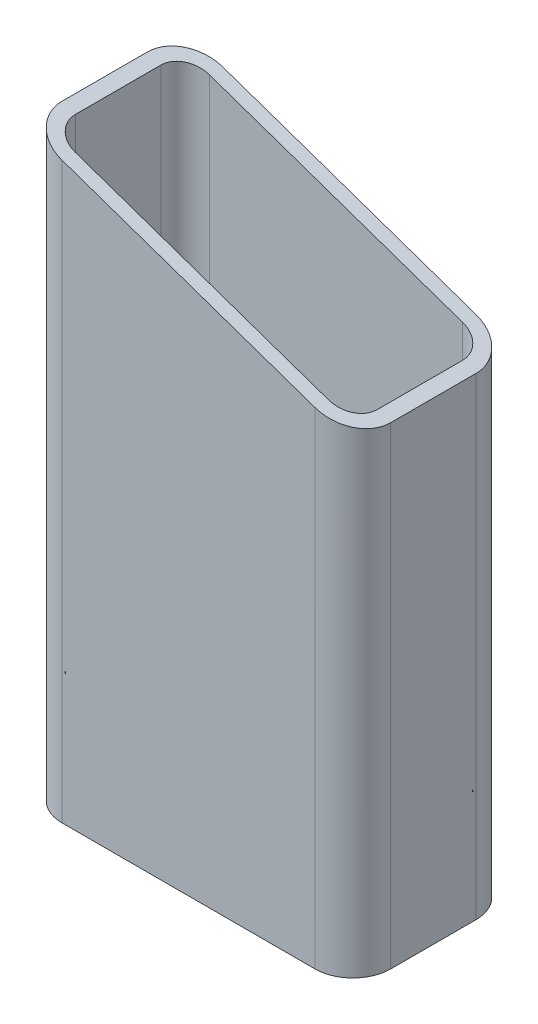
ISO-10303-21;
HEADER;
FILE_DESCRIPTION(('STEP AP214'),'2;1');
FILE_NAME('part.step','',(''),(''),'','','');
FILE_SCHEMA(('AUTOMOTIVE_DESIGN { 1 0 10303 214 1 1 1 1 }'));
ENDSEC;
DATA;
#1=APPLICATION_CONTEXT('core data for automotive mechanical design processes');
#2=APPLICATION_PROTOCOL_DEFINITION('international standard','automotive_design',2000,#1);
#3=PRODUCT_CONTEXT('',#1,'mechanical');
#4=PRODUCT('Part','Part','',(#3));
#5=PRODUCT_RELATED_PRODUCT_CATEGORY('part','',(#4));
#6=PRODUCT_DEFINITION_FORMATION('','',#4);
#7=PRODUCT_DEFINITION_CONTEXT('part definition',#1,'design');
#8=PRODUCT_DEFINITION('design','',#6,#7);
#9=PRODUCT_DEFINITION_SHAPE('','',#8);
#10=(LENGTH_UNIT() NAMED_UNIT(*) SI_UNIT(.MILLI.,.METRE.));
#11=(NAMED_UNIT(*) PLANE_ANGLE_UNIT() SI_UNIT($,.RADIAN.));
#12=(NAMED_UNIT(*) SI_UNIT($,.STERADIAN.) SOLID_ANGLE_UNIT());
#13=UNCERTAINTY_MEASURE_WITH_UNIT(LENGTH_MEASURE(1.E-05),#10,'distance_accuracy_value','');
#14=(GEOMETRIC_REPRESENTATION_CONTEXT(3) GLOBAL_UNCERTAINTY_ASSIGNED_CONTEXT((#13)) GLOBAL_UNIT_ASSIGNED_CONTEXT((#10,
#11,#12)) REPRESENTATION_CONTEXT('',''));
#15=CARTESIAN_POINT('',(0.,0.,0.));
#16=DIRECTION('',(0.,0.,1.));
#17=DIRECTION('',(1.,0.,0.));
#18=AXIS2_PLACEMENT_3D('',#15,#16,#17);
#19=CARTESIAN_POINT('',(90.,350.,0.));
#20=DIRECTION('',(1.,0.,0.));
#21=DIRECTION('',(0.,0.,-1.));
#22=AXIS2_PLACEMENT_3D('',#19,#20,#21);
#23=PLANE('',#22);
#24=DIRECTION('',(0.,-1.,0.));
#25=VECTOR('',#24,1.);
#26=CARTESIAN_POINT('',(90.,350.,25.5));
#27=LINE('',#26,#25);
#28=CARTESIAN_POINT('',(90.,284.83571951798,25.5));
#29=VERTEX_POINT('',#28);
#30=CARTESIAN_POINT('',(90.,0.,25.5));
#31=VERTEX_POINT('',#30);
#32=EDGE_CURVE('E11',#29,#31,#27,.T.);
#33=ORIENTED_EDGE('',*,*,#32,.F.);
#34=DIRECTION('',(0.,0.,-1.));
#35=VECTOR('',#34,1.);
#36=CARTESIAN_POINT('',(90.,284.83571951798,0.));
#37=LINE('',#36,#35);
#38=CARTESIAN_POINT('',(90.,284.83571951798,-25.5000000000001));
#39=VERTEX_POINT('',#38);
#40=EDGE_CURVE('E258',#29,#39,#37,.T.);
#41=ORIENTED_EDGE('',*,*,#40,.T.);
#42=DIRECTION('',(0.,-1.,0.));
#43=VECTOR('',#42,1.);
#44=CARTESIAN_POINT('',(90.,350.,-25.5000000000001));
#45=LINE('',#44,#43);
#46=CARTESIAN_POINT('',(90.,0.,-25.5000000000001));
#47=VERTEX_POINT('',#46);
#48=EDGE_CURVE('E122',#39,#47,#45,.T.);
#49=ORIENTED_EDGE('',*,*,#48,.T.);
#50=DIRECTION('',(0.,0.,1.));
#51=VECTOR('',#50,1.);
#52=CARTESIAN_POINT('',(90.,0.,0.));
#53=LINE('',#52,#51);
#54=EDGE_CURVE('E137',#47,#31,#53,.T.);
#55=ORIENTED_EDGE('',*,*,#54,.T.);
#56=EDGE_LOOP('',(#33,#41,#49,#55));
#57=FACE_BOUND('',#56,.T.);
#58=ADVANCED_FACE('F34',(#57),#23,.F.);
#59=CARTESIAN_POINT('',(75.5,350.,25.5));
#60=DIRECTION('',(0.,-1.,0.));
#61=DIRECTION('',(0.,0.,-1.));
#62=AXIS2_PLACEMENT_3D('',#59,#60,#61);
#63=CYLINDRICAL_SURFACE('',#62,14.5);
#64=DIRECTION('',(0.,-1.,0.));
#65=VECTOR('',#64,1.);
#66=CARTESIAN_POINT('',(75.5,350.,40.));
#67=LINE('',#66,#65);
#68=CARTESIAN_POINT('',(75.5,289.861687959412,40.));
#69=VERTEX_POINT('',#68);
#70=CARTESIAN_POINT('',(75.5,0.,40.));
#71=VERTEX_POINT('',#70);
#72=EDGE_CURVE('E43',#69,#71,#67,.T.);
#73=ORIENTED_EDGE('',*,*,#72,.F.);
#74=CARTESIAN_POINT('',(75.5,289.861687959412,25.5));
#75=DIRECTION('',(-0.327502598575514,-0.944850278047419,0.));
#76=DIRECTION('',(0.94485027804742,-0.327502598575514,0.));
#77=AXIS2_PLACEMENT_3D('',#74,#75,#76);
#78=ELLIPSE('',#77,15.3463467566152,14.5);
#79=EDGE_CURVE('E253',#69,#29,#78,.F.);
#80=ORIENTED_EDGE('',*,*,#79,.T.);
#81=ORIENTED_EDGE('',*,*,#32,.T.);
#82=CARTESIAN_POINT('',(75.5,0.,25.5));
#83=DIRECTION('',(0.,1.,0.));
#84=DIRECTION('',(0.,0.,1.));
#85=AXIS2_PLACEMENT_3D('',#82,#83,#84);
#86=CIRCLE('',#85,14.5);
#87=EDGE_CURVE('E209',#31,#71,#86,.F.);
#88=ORIENTED_EDGE('',*,*,#87,.T.);
#89=EDGE_LOOP('',(#73,#80,#81,#88));
#90=FACE_BOUND('',#89,.T.);
#91=ADVANCED_FACE('F250',(#90),#63,.F.);
#92=CARTESIAN_POINT('',(0.,350.,40.));
#93=DIRECTION('',(0.,0.,-1.));
#94=DIRECTION('',(-1.,0.,0.));
#95=AXIS2_PLACEMENT_3D('',#92,#93,#94);
#96=PLANE('',#95);
#97=DIRECTION('',(-0.94485027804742,0.327502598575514,0.));
#98=VECTOR('',#97,1.);
#99=CARTESIAN_POINT('',(-10.511279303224,319.674789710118,40.));
#100=LINE('',#99,#98);
#101=CARTESIAN_POINT('',(-75.5,342.20108345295,40.0000000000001));
#102=VERTEX_POINT('',#101);
#103=EDGE_CURVE('E247',#69,#102,#100,.T.);
#104=ORIENTED_EDGE('',*,*,#103,.F.);
#105=ORIENTED_EDGE('',*,*,#72,.T.);
#106=DIRECTION('',(1.,0.,0.));
#107=VECTOR('',#106,1.);
#108=CARTESIAN_POINT('',(0.,0.,40.));
#109=LINE('',#108,#107);
#110=CARTESIAN_POINT('',(-75.5,0.,40.0000000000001));
#111=VERTEX_POINT('',#110);
#112=EDGE_CURVE('E212',#111,#71,#109,.T.);
#113=ORIENTED_EDGE('',*,*,#112,.F.);
#114=DIRECTION('',(0.,-1.,0.));
#115=VECTOR('',#114,1.);
#116=CARTESIAN_POINT('',(-75.5,350.,40.0000000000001));
#117=LINE('',#116,#115);
#118=EDGE_CURVE('E150',#102,#111,#117,.T.);
#119=ORIENTED_EDGE('',*,*,#118,.F.);
#120=EDGE_LOOP('',(#104,#105,#113,#119));
#121=FACE_BOUND('',#120,.T.);
#122=ADVANCED_FACE('F242',(#121),#96,.T.);
#123=CARTESIAN_POINT('',(-75.5,350.,25.5000000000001));
#124=DIRECTION('',(0.,-1.,0.));
#125=DIRECTION('',(0.,0.,-1.));
#126=AXIS2_PLACEMENT_3D('',#123,#124,#125);
#127=CYLINDRICAL_SURFACE('',#126,14.5);
#128=CARTESIAN_POINT('',(-75.5,342.20108345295,25.5000000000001));
#129=DIRECTION('',(-0.327502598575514,-0.944850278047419,0.));
#130=DIRECTION('',(0.94485027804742,-0.327502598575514,0.));
#131=AXIS2_PLACEMENT_3D('',#128,#129,#130);
#132=ELLIPSE('',#131,15.3463467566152,14.5);
#133=CARTESIAN_POINT('',(-90.,347.227051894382,25.5000000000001));
#134=VERTEX_POINT('',#133);
#135=EDGE_CURVE('E569',#102,#134,#132,.T.);
#136=ORIENTED_EDGE('',*,*,#135,.F.);
#137=ORIENTED_EDGE('',*,*,#118,.T.);
#138=CARTESIAN_POINT('',(-75.5,0.,25.5000000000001));
#139=DIRECTION('',(0.,1.,0.));
#140=DIRECTION('',(0.,0.,1.));
#141=AXIS2_PLACEMENT_3D('',#138,#139,#140);
#142=CIRCLE('',#141,14.5);
#143=CARTESIAN_POINT('',(-90.,0.,25.5000000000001));
#144=VERTEX_POINT('',#143);
#145=EDGE_CURVE('E215',#144,#111,#142,.T.);
#146=ORIENTED_EDGE('',*,*,#145,.F.);
#147=DIRECTION('',(0.,-1.,0.));
#148=VECTOR('',#147,1.);
#149=CARTESIAN_POINT('',(-90.,350.,25.5000000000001));
#150=LINE('',#149,#148);
#151=EDGE_CURVE('E148',#134,#144,#150,.T.);
#152=ORIENTED_EDGE('',*,*,#151,.F.);
#153=EDGE_LOOP('',(#136,#137,#146,#152));
#154=FACE_BOUND('',#153,.T.);
#155=ADVANCED_FACE('F237',(#154),#127,.F.);
#156=CARTESIAN_POINT('',(-90.,350.,0.));
#157=DIRECTION('',(1.,0.,0.));
#158=DIRECTION('',(0.,0.,-1.));
#159=AXIS2_PLACEMENT_3D('',#156,#157,#158);
#160=PLANE('',#159);
#161=DIRECTION('',(0.,0.,-1.));
#162=VECTOR('',#161,1.);
#163=CARTESIAN_POINT('',(-90.,347.227051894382,0.));
#164=LINE('',#163,#162);
#165=CARTESIAN_POINT('',(-90.,347.227051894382,-25.5000000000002));
#166=VERTEX_POINT('',#165);
#167=EDGE_CURVE('E234',#134,#166,#164,.T.);
#168=ORIENTED_EDGE('',*,*,#167,.F.);
#169=ORIENTED_EDGE('',*,*,#151,.T.);
#170=DIRECTION('',(0.,0.,1.));
#171=VECTOR('',#170,1.);
#172=CARTESIAN_POINT('',(-90.,0.,0.));
#173=LINE('',#172,#171);
#174=CARTESIAN_POINT('',(-90.,0.,-25.5000000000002));
#175=VERTEX_POINT('',#174);
#176=EDGE_CURVE('E218',#175,#144,#173,.T.);
#177=ORIENTED_EDGE('',*,*,#176,.F.);
#178=DIRECTION('',(0.,-1.,0.));
#179=VECTOR('',#178,1.);
#180=CARTESIAN_POINT('',(-90.,350.,-25.5000000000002));
#181=LINE('',#180,#179);
#182=EDGE_CURVE('E146',#166,#175,#181,.T.);
#183=ORIENTED_EDGE('',*,*,#182,.F.);
#184=EDGE_LOOP('',(#168,#169,#177,#183));
#185=FACE_BOUND('',#184,.T.);
#186=ADVANCED_FACE('F228',(#185),#160,.T.);
#187=CARTESIAN_POINT('',(-75.5,350.,-25.5000000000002));
#188=DIRECTION('',(0.,-1.,0.));
#189=DIRECTION('',(0.,0.,-1.));
#190=AXIS2_PLACEMENT_3D('',#187,#188,#189);
#191=CYLINDRICAL_SURFACE('',#190,14.5);
#192=DIRECTION('',(0.,-1.,0.));
#193=VECTOR('',#192,1.);
#194=CARTESIAN_POINT('',(-75.5,350.,-40.0000000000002));
#195=LINE('',#194,#193);
#196=CARTESIAN_POINT('',(-75.5,342.20108345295,-40.0000000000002));
#197=VERTEX_POINT('',#196);
#198=CARTESIAN_POINT('',(-75.5,0.,-40.0000000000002));
#199=VERTEX_POINT('',#198);
#200=EDGE_CURVE('E121',#197,#199,#195,.T.);
#201=ORIENTED_EDGE('',*,*,#200,.F.);
#202=CARTESIAN_POINT('',(-75.5,342.20108345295,-25.5000000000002));
#203=DIRECTION('',(-0.327502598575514,-0.944850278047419,0.));
#204=DIRECTION('',(0.94485027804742,-0.327502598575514,0.));
#205=AXIS2_PLACEMENT_3D('',#202,#203,#204);
#206=ELLIPSE('',#205,15.3463467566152,14.5);
#207=EDGE_CURVE('E572',#197,#166,#206,.F.);
#208=ORIENTED_EDGE('',*,*,#207,.T.);
#209=ORIENTED_EDGE('',*,*,#182,.T.);
#210=CARTESIAN_POINT('',(-75.5,0.,-25.5000000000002));
#211=DIRECTION('',(0.,1.,0.));
#212=DIRECTION('',(0.,0.,1.));
#213=AXIS2_PLACEMENT_3D('',#210,#211,#212);
#214=CIRCLE('',#213,14.5);
#215=EDGE_CURVE('E131',#175,#199,#214,.F.);
#216=ORIENTED_EDGE('',*,*,#215,.T.);
#217=EDGE_LOOP('',(#201,#208,#209,#216));
#218=FACE_BOUND('',#217,.T.);
#219=ADVANCED_FACE('F221',(#218),#191,.F.);
#220=CARTESIAN_POINT('',(0.,350.,-40.0000000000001));
#221=DIRECTION('',(0.,0.,-1.));
#222=DIRECTION('',(-1.,0.,0.));
#223=AXIS2_PLACEMENT_3D('',#220,#221,#222);
#224=PLANE('',#223);
#225=DIRECTION('',(0.,-1.,0.));
#226=VECTOR('',#225,1.);
#227=CARTESIAN_POINT('',(75.5,350.,-40.0000000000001));
#228=LINE('',#227,#226);
#229=CARTESIAN_POINT('',(75.5,289.861687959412,-40.0000000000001));
#230=VERTEX_POINT('',#229);
#231=CARTESIAN_POINT('',(75.5,0.,-40.0000000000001));
#232=VERTEX_POINT('',#231);
#233=EDGE_CURVE('E113',#230,#232,#228,.T.);
#234=ORIENTED_EDGE('',*,*,#233,.F.);
#235=DIRECTION('',(-0.94485027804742,0.327502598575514,0.));
#236=VECTOR('',#235,1.);
#237=CARTESIAN_POINT('',(-10.511279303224,319.674789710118,-40.0000000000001));
#238=LINE('',#237,#236);
#239=EDGE_CURVE('E51',#230,#197,#238,.T.);
#240=ORIENTED_EDGE('',*,*,#239,.T.);
#241=ORIENTED_EDGE('',*,*,#200,.T.);
#242=DIRECTION('',(1.,0.,0.));
#243=VECTOR('',#242,1.);
#244=CARTESIAN_POINT('',(0.,0.,-40.0000000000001));
#245=LINE('',#244,#243);
#246=EDGE_CURVE('E125',#199,#232,#245,.T.);
#247=ORIENTED_EDGE('',*,*,#246,.T.);
#248=EDGE_LOOP('',(#234,#240,#241,#247));
#249=FACE_BOUND('',#248,.T.);
#250=ADVANCED_FACE('F126',(#249),#224,.F.);
#251=CARTESIAN_POINT('',(75.5,350.,25.5));
#252=DIRECTION('',(0.,-1.,0.));
#253=DIRECTION('',(0.,0.,-1.));
#254=AXIS2_PLACEMENT_3D('',#251,#252,#253);
#255=CYLINDRICAL_SURFACE('',#254,22.5);
#256=CARTESIAN_POINT('',(75.5,289.861687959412,25.5));
#257=DIRECTION('',(-0.327502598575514,-0.944850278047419,0.));
#258=DIRECTION('',(0.94485027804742,-0.327502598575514,0.));
#259=AXIS2_PLACEMENT_3D('',#256,#257,#258);
#260=ELLIPSE('',#259,23.8132966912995,22.5);
#261=CARTESIAN_POINT('',(75.5000000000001,289.861687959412,48.));
#262=VERTEX_POINT('',#261);
#263=CARTESIAN_POINT('',(98.,282.062771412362,25.4999999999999));
#264=VERTEX_POINT('',#263);
#265=EDGE_CURVE('E189',#262,#264,#260,.F.);
#266=ORIENTED_EDGE('',*,*,#265,.F.);
#267=DIRECTION('',(0.,-1.,0.));
#268=VECTOR('',#267,1.);
#269=CARTESIAN_POINT('',(75.5,350.,48.));
#270=LINE('',#269,#268);
#271=CARTESIAN_POINT('',(75.5,0.,48.));
#272=VERTEX_POINT('',#271);
#273=EDGE_CURVE('E140',#262,#272,#270,.T.);
#274=ORIENTED_EDGE('',*,*,#273,.T.);
#275=CARTESIAN_POINT('',(75.5,0.,25.5));
#276=DIRECTION('',(0.,1.,0.));
#277=DIRECTION('',(0.,0.,1.));
#278=AXIS2_PLACEMENT_3D('',#275,#276,#277);
#279=CIRCLE('',#278,22.5);
#280=CARTESIAN_POINT('',(98.,0.,25.5));
#281=VERTEX_POINT('',#280);
#282=EDGE_CURVE('E184',#281,#272,#279,.F.);
#283=ORIENTED_EDGE('',*,*,#282,.F.);
#284=DIRECTION('',(0.,-1.,0.));
#285=VECTOR('',#284,1.);
#286=CARTESIAN_POINT('',(98.,350.,25.5));
#287=LINE('',#286,#285);
#288=EDGE_CURVE('E38',#264,#281,#287,.T.);
#289=ORIENTED_EDGE('',*,*,#288,.F.);
#290=EDGE_LOOP('',(#266,#274,#283,#289));
#291=FACE_BOUND('',#290,.T.);
#292=ADVANCED_FACE('F36',(#291),#255,.T.);
#293=CARTESIAN_POINT('',(98.,350.,0.));
#294=DIRECTION('',(1.,0.,0.));
#295=DIRECTION('',(0.,0.,-1.));
#296=AXIS2_PLACEMENT_3D('',#293,#294,#295);
#297=PLANE('',#296);
#298=DIRECTION('',(0.,0.,1.));
#299=VECTOR('',#298,1.);
#300=CARTESIAN_POINT('',(98.,282.062771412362,-48.0000000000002));
#301=LINE('',#300,#299);
#302=CARTESIAN_POINT('',(98.,282.062771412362,-25.5000000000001));
#303=VERTEX_POINT('',#302);
#304=EDGE_CURVE('E180',#303,#264,#301,.T.);
#305=ORIENTED_EDGE('',*,*,#304,.T.);
#306=ORIENTED_EDGE('',*,*,#288,.T.);
#307=DIRECTION('',(0.,0.,1.));
#308=VECTOR('',#307,1.);
#309=CARTESIAN_POINT('',(98.,0.,0.));
#310=LINE('',#309,#308);
#311=CARTESIAN_POINT('',(98.,0.,-25.5000000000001));
#312=VERTEX_POINT('',#311);
#313=EDGE_CURVE('E177',#312,#281,#310,.T.);
#314=ORIENTED_EDGE('',*,*,#313,.F.);
#315=DIRECTION('',(0.,-1.,0.));
#316=VECTOR('',#315,1.);
#317=CARTESIAN_POINT('',(98.,350.,-25.5000000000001));
#318=LINE('',#317,#316);
#319=EDGE_CURVE('E164',#303,#312,#318,.T.);
#320=ORIENTED_EDGE('',*,*,#319,.F.);
#321=EDGE_LOOP('',(#305,#306,#314,#320));
#322=FACE_BOUND('',#321,.T.);
#323=ADVANCED_FACE('F175',(#322),#297,.T.);
#324=CARTESIAN_POINT('',(75.5,350.,-25.5000000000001));
#325=DIRECTION('',(0.,-1.,0.));
#326=DIRECTION('',(0.,0.,-1.));
#327=AXIS2_PLACEMENT_3D('',#324,#325,#326);
#328=CYLINDRICAL_SURFACE('',#327,22.5);
#329=DIRECTION('',(0.,-1.,0.));
#330=VECTOR('',#329,1.);
#331=CARTESIAN_POINT('',(75.5,350.,-48.0000000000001));
#332=LINE('',#331,#330);
#333=CARTESIAN_POINT('',(75.5000000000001,289.861687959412,-48.0000000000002));
#334=VERTEX_POINT('',#333);
#335=CARTESIAN_POINT('',(75.5,0.,-48.0000000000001));
#336=VERTEX_POINT('',#335);
#337=EDGE_CURVE('E163',#334,#336,#332,.T.);
#338=ORIENTED_EDGE('',*,*,#337,.F.);
#339=CARTESIAN_POINT('',(75.5,289.861687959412,-25.5000000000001));
#340=DIRECTION('',(-0.327502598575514,-0.944850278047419,0.));
#341=DIRECTION('',(0.94485027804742,-0.327502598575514,0.));
#342=AXIS2_PLACEMENT_3D('',#339,#340,#341);
#343=ELLIPSE('',#342,23.8132966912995,22.5);
#344=EDGE_CURVE('E561',#334,#303,#343,.T.);
#345=ORIENTED_EDGE('',*,*,#344,.T.);
#346=ORIENTED_EDGE('',*,*,#319,.T.);
#347=CARTESIAN_POINT('',(75.5,0.,-25.5000000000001));
#348=DIRECTION('',(0.,1.,0.));
#349=DIRECTION('',(0.,0.,1.));
#350=AXIS2_PLACEMENT_3D('',#347,#348,#349);
#351=CIRCLE('',#350,22.5);
#352=EDGE_CURVE('E192',#312,#336,#351,.T.);
#353=ORIENTED_EDGE('',*,*,#352,.T.);
#354=EDGE_LOOP('',(#338,#345,#346,#353));
#355=FACE_BOUND('',#354,.T.);
#356=ADVANCED_FACE('F309',(#355),#328,.T.);
#357=CARTESIAN_POINT('',(0.,350.,-48.0000000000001));
#358=DIRECTION('',(0.,0.,-1.));
#359=DIRECTION('',(-1.,0.,0.));
#360=AXIS2_PLACEMENT_3D('',#357,#358,#359);
#361=PLANE('',#360);
#362=DIRECTION('',(0.94485027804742,-0.327502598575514,0.));
#363=VECTOR('',#362,1.);
#364=CARTESIAN_POINT('',(-98.,350.,-48.0000000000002));
#365=LINE('',#364,#363);
#366=CARTESIAN_POINT('',(-75.5,342.20108345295,-48.0000000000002));
#367=VERTEX_POINT('',#366);
#368=EDGE_CURVE('E294',#367,#334,#365,.T.);
#369=ORIENTED_EDGE('',*,*,#368,.T.);
#370=ORIENTED_EDGE('',*,*,#337,.T.);
#371=DIRECTION('',(1.,0.,0.));
#372=VECTOR('',#371,1.);
#373=CARTESIAN_POINT('',(0.,0.,-48.0000000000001));
#374=LINE('',#373,#372);
#375=CARTESIAN_POINT('',(-75.5,0.,-48.0000000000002));
#376=VERTEX_POINT('',#375);
#377=EDGE_CURVE('E194',#376,#336,#374,.T.);
#378=ORIENTED_EDGE('',*,*,#377,.F.);
#379=DIRECTION('',(0.,-1.,0.));
#380=VECTOR('',#379,1.);
#381=CARTESIAN_POINT('',(-75.5,350.,-48.0000000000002));
#382=LINE('',#381,#380);
#383=EDGE_CURVE('E161',#367,#376,#382,.T.);
#384=ORIENTED_EDGE('',*,*,#383,.F.);
#385=EDGE_LOOP('',(#369,#370,#378,#384));
#386=FACE_BOUND('',#385,.T.);
#387=ADVANCED_FACE('F307',(#386),#361,.T.);
#388=CARTESIAN_POINT('',(-75.5,350.,-25.5000000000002));
#389=DIRECTION('',(0.,-1.,0.));
#390=DIRECTION('',(0.,0.,-1.));
#391=AXIS2_PLACEMENT_3D('',#388,#389,#390);
#392=CYLINDRICAL_SURFACE('',#391,22.5);
#393=CARTESIAN_POINT('',(-75.5,342.20108345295,-25.5000000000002));
#394=DIRECTION('',(-0.327502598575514,-0.944850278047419,0.));
#395=DIRECTION('',(0.94485027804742,-0.327502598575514,0.));
#396=AXIS2_PLACEMENT_3D('',#393,#394,#395);
#397=ELLIPSE('',#396,23.8132966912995,22.5);
#398=CARTESIAN_POINT('',(-98.,350.,-25.5000000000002));
#399=VERTEX_POINT('',#398);
#400=EDGE_CURVE('E60',#367,#399,#397,.F.);
#401=ORIENTED_EDGE('',*,*,#400,.F.);
#402=ORIENTED_EDGE('',*,*,#383,.T.);
#403=CARTESIAN_POINT('',(-75.5,0.,-25.5000000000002));
#404=DIRECTION('',(0.,1.,0.));
#405=DIRECTION('',(0.,0.,1.));
#406=AXIS2_PLACEMENT_3D('',#403,#404,#405);
#407=CIRCLE('',#406,22.5);
#408=CARTESIAN_POINT('',(-98.,0.,-25.5000000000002));
#409=VERTEX_POINT('',#408);
#410=EDGE_CURVE('E198',#409,#376,#407,.F.);
#411=ORIENTED_EDGE('',*,*,#410,.F.);
#412=DIRECTION('',(0.,-1.,0.));
#413=VECTOR('',#412,1.);
#414=CARTESIAN_POINT('',(-98.,350.,-25.5000000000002));
#415=LINE('',#414,#413);
#416=EDGE_CURVE('E159',#399,#409,#415,.T.);
#417=ORIENTED_EDGE('',*,*,#416,.F.);
#418=EDGE_LOOP('',(#401,#402,#411,#417));
#419=FACE_BOUND('',#418,.T.);
#420=ADVANCED_FACE('F302',(#419),#392,.T.);
#421=CARTESIAN_POINT('',(-98.,350.,0.));
#422=DIRECTION('',(1.,0.,0.));
#423=DIRECTION('',(0.,0.,-1.));
#424=AXIS2_PLACEMENT_3D('',#421,#422,#423);
#425=PLANE('',#424);
#426=DIRECTION('',(0.,0.,1.));
#427=VECTOR('',#426,1.);
#428=CARTESIAN_POINT('',(-98.,0.,0.));
#429=LINE('',#428,#427);
#430=CARTESIAN_POINT('',(-98.,0.,25.5000000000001));
#431=VERTEX_POINT('',#430);
#432=EDGE_CURVE('E201',#409,#431,#429,.T.);
#433=ORIENTED_EDGE('',*,*,#432,.T.);
#434=DIRECTION('',(0.,-1.,0.));
#435=VECTOR('',#434,1.);
#436=CARTESIAN_POINT('',(-98.,350.,25.5000000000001));
#437=LINE('',#436,#435);
#438=CARTESIAN_POINT('',(-98.,350.,25.5));
#439=VERTEX_POINT('',#438);
#440=EDGE_CURVE('E156',#439,#431,#437,.T.);
#441=ORIENTED_EDGE('',*,*,#440,.F.);
#442=DIRECTION('',(0.,0.,1.));
#443=VECTOR('',#442,1.);
#444=CARTESIAN_POINT('',(-98.,350.,0.));
#445=LINE('',#444,#443);
#446=EDGE_CURVE('E138',#399,#439,#445,.T.);
#447=ORIENTED_EDGE('',*,*,#446,.F.);
#448=ORIENTED_EDGE('',*,*,#416,.T.);
#449=EDGE_LOOP('',(#433,#441,#447,#448));
#450=FACE_BOUND('',#449,.T.);
#451=ADVANCED_FACE('F329',(#450),#425,.F.);
#452=CARTESIAN_POINT('',(-75.5,350.,25.5000000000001));
#453=DIRECTION('',(0.,-1.,0.));
#454=DIRECTION('',(0.,0.,-1.));
#455=AXIS2_PLACEMENT_3D('',#452,#453,#454);
#456=CYLINDRICAL_SURFACE('',#455,22.5);
#457=DIRECTION('',(0.,-1.,0.));
#458=VECTOR('',#457,1.);
#459=CARTESIAN_POINT('',(-75.5,350.,48.0000000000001));
#460=LINE('',#459,#458);
#461=CARTESIAN_POINT('',(-75.5,342.20108345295,48.));
#462=VERTEX_POINT('',#461);
#463=CARTESIAN_POINT('',(-75.5,0.,48.0000000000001));
#464=VERTEX_POINT('',#463);
#465=EDGE_CURVE('E154',#462,#464,#460,.T.);
#466=ORIENTED_EDGE('',*,*,#465,.F.);
#467=CARTESIAN_POINT('',(-75.5,342.20108345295,25.5000000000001));
#468=DIRECTION('',(-0.327502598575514,-0.944850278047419,0.));
#469=DIRECTION('',(0.94485027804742,-0.327502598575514,0.));
#470=AXIS2_PLACEMENT_3D('',#467,#468,#469);
#471=ELLIPSE('',#470,23.8132966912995,22.5);
#472=EDGE_CURVE('E283',#462,#439,#471,.T.);
#473=ORIENTED_EDGE('',*,*,#472,.T.);
#474=ORIENTED_EDGE('',*,*,#440,.T.);
#475=CARTESIAN_POINT('',(-75.5,0.,25.5000000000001));
#476=DIRECTION('',(0.,1.,0.));
#477=DIRECTION('',(0.,0.,1.));
#478=AXIS2_PLACEMENT_3D('',#475,#476,#477);
#479=CIRCLE('',#478,22.5);
#480=EDGE_CURVE('E203',#431,#464,#479,.T.);
#481=ORIENTED_EDGE('',*,*,#480,.T.);
#482=EDGE_LOOP('',(#466,#473,#474,#481));
#483=FACE_BOUND('',#482,.T.);
#484=ADVANCED_FACE('F296',(#483),#456,.T.);
#485=CARTESIAN_POINT('',(0.,350.,48.));
#486=DIRECTION('',(0.,0.,-1.));
#487=DIRECTION('',(-1.,0.,0.));
#488=AXIS2_PLACEMENT_3D('',#485,#486,#487);
#489=PLANE('',#488);
#490=ORIENTED_EDGE('',*,*,#273,.F.);
#491=DIRECTION('',(0.94485027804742,-0.327502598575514,0.));
#492=VECTOR('',#491,1.);
#493=CARTESIAN_POINT('',(-98.,350.,48.));
#494=LINE('',#493,#492);
#495=EDGE_CURVE('E286',#462,#262,#494,.T.);
#496=ORIENTED_EDGE('',*,*,#495,.F.);
#497=ORIENTED_EDGE('',*,*,#465,.T.);
#498=DIRECTION('',(1.,0.,0.));
#499=VECTOR('',#498,1.);
#500=CARTESIAN_POINT('',(0.,0.,48.));
#501=LINE('',#500,#499);
#502=EDGE_CURVE('E206',#464,#272,#501,.T.);
#503=ORIENTED_EDGE('',*,*,#502,.T.);
#504=EDGE_LOOP('',(#490,#496,#497,#503));
#505=FACE_BOUND('',#504,.T.);
#506=ADVANCED_FACE('F293',(#505),#489,.F.);
#507=CARTESIAN_POINT('',(75.5,350.,-25.5000000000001));
#508=DIRECTION('',(0.,-1.,0.));
#509=DIRECTION('',(0.,0.,-1.));
#510=AXIS2_PLACEMENT_3D('',#507,#508,#509);
#511=CYLINDRICAL_SURFACE('',#510,14.5);
#512=CARTESIAN_POINT('',(75.5,289.861687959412,-25.5000000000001));
#513=DIRECTION('',(-0.327502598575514,-0.944850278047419,0.));
#514=DIRECTION('',(0.94485027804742,-0.327502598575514,0.));
#515=AXIS2_PLACEMENT_3D('',#512,#513,#514);
#516=ELLIPSE('',#515,15.3463467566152,14.5);
#517=EDGE_CURVE('E119',#230,#39,#516,.T.);
#518=ORIENTED_EDGE('',*,*,#517,.F.);
#519=ORIENTED_EDGE('',*,*,#233,.T.);
#520=CARTESIAN_POINT('',(75.5,0.,-25.5000000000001));
#521=DIRECTION('',(0.,1.,0.));
#522=DIRECTION('',(0.,0.,1.));
#523=AXIS2_PLACEMENT_3D('',#520,#521,#522);
#524=CIRCLE('',#523,14.5);
#525=EDGE_CURVE('E118',#47,#232,#524,.T.);
#526=ORIENTED_EDGE('',*,*,#525,.F.);
#527=ORIENTED_EDGE('',*,*,#48,.F.);
#528=EDGE_LOOP('',(#518,#519,#526,#527));
#529=FACE_BOUND('',#528,.T.);
#530=ADVANCED_FACE('F115',(#529),#511,.F.);
#531=CARTESIAN_POINT('',(0.,0.,0.));
#532=DIRECTION('',(0.,1.,0.));
#533=DIRECTION('',(0.,0.,1.));
#534=AXIS2_PLACEMENT_3D('',#531,#532,#533);
#535=PLANE('',#534);
#536=ORIENTED_EDGE('',*,*,#282,.T.);
#537=ORIENTED_EDGE('',*,*,#502,.F.);
#538=ORIENTED_EDGE('',*,*,#480,.F.);
#539=ORIENTED_EDGE('',*,*,#432,.F.);
#540=ORIENTED_EDGE('',*,*,#410,.T.);
#541=ORIENTED_EDGE('',*,*,#377,.T.);
#542=ORIENTED_EDGE('',*,*,#352,.F.);
#543=ORIENTED_EDGE('',*,*,#313,.T.);
#544=EDGE_LOOP('',(#536,#537,#538,#539,#540,#541,#542,#543));
#545=FACE_BOUND('',#544,.T.);
#546=ORIENTED_EDGE('',*,*,#54,.F.);
#547=ORIENTED_EDGE('',*,*,#525,.T.);
#548=ORIENTED_EDGE('',*,*,#246,.F.);
#549=ORIENTED_EDGE('',*,*,#215,.F.);
#550=ORIENTED_EDGE('',*,*,#176,.T.);
#551=ORIENTED_EDGE('',*,*,#145,.T.);
#552=ORIENTED_EDGE('',*,*,#112,.T.);
#553=ORIENTED_EDGE('',*,*,#87,.F.);
#554=EDGE_LOOP('',(#546,#547,#548,#549,#550,#551,#552,#553));
#555=FACE_BOUND('',#554,.T.);
#556=ADVANCED_FACE('F134',(#545,#555),#535,.F.);
#557=CARTESIAN_POINT('',(-98.,350.,-48.0000000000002));
#558=DIRECTION('',(-0.327502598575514,-0.944850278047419,0.));
#559=DIRECTION('',(0.94485027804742,-0.327502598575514,0.));
#560=AXIS2_PLACEMENT_3D('',#557,#558,#559);
#561=PLANE('',#560);
#562=ORIENTED_EDGE('',*,*,#265,.T.);
#563=ORIENTED_EDGE('',*,*,#304,.F.);
#564=ORIENTED_EDGE('',*,*,#344,.F.);
#565=ORIENTED_EDGE('',*,*,#368,.F.);
#566=ORIENTED_EDGE('',*,*,#400,.T.);
#567=ORIENTED_EDGE('',*,*,#446,.T.);
#568=ORIENTED_EDGE('',*,*,#472,.F.);
#569=ORIENTED_EDGE('',*,*,#495,.T.);
#570=EDGE_LOOP('',(#562,#563,#564,#565,#566,#567,#568,#569));
#571=FACE_BOUND('',#570,.T.);
#572=ORIENTED_EDGE('',*,*,#79,.F.);
#573=ORIENTED_EDGE('',*,*,#103,.T.);
#574=ORIENTED_EDGE('',*,*,#135,.T.);
#575=ORIENTED_EDGE('',*,*,#167,.T.);
#576=ORIENTED_EDGE('',*,*,#207,.F.);
#577=ORIENTED_EDGE('',*,*,#239,.F.);
#578=ORIENTED_EDGE('',*,*,#517,.T.);
#579=ORIENTED_EDGE('',*,*,#40,.F.);
#580=EDGE_LOOP('',(#572,#573,#574,#575,#576,#577,#578,#579));
#581=FACE_BOUND('',#580,.T.);
#582=ADVANCED_FACE('F285',(#571,#581),#561,.F.);
#583=CLOSED_SHELL('',(#58,#91,#122,#155,#186,#219,#250,#292,#323,#356,#387,#420,#451,#484,#506,
#530,#556,#582));
#584=MANIFOLD_SOLID_BREP('B2',#583);
#585=ADVANCED_BREP_SHAPE_REPRESENTATION('',(#18,#584),#14);
#586=SHAPE_DEFINITION_REPRESENTATION(#9,#585);
ENDSEC;
END-ISO-10303-21;
